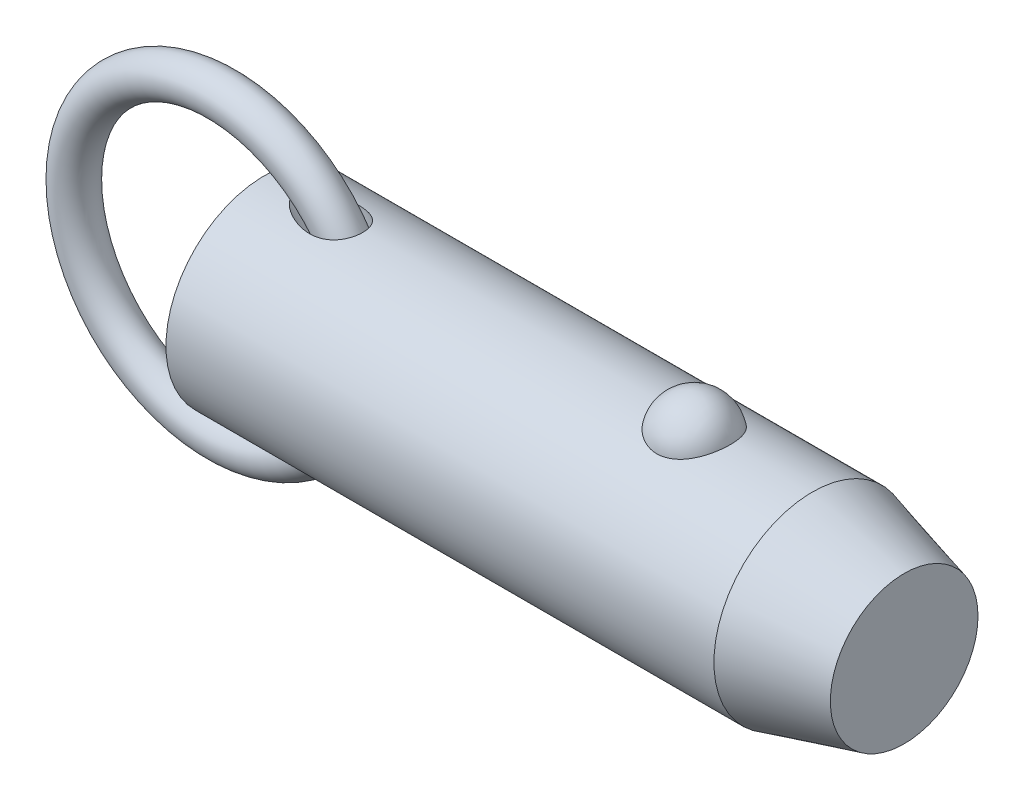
ISO-10303-21;
HEADER;
FILE_DESCRIPTION(('STEP AP214'),'2;1');
FILE_NAME('part.step','',(''),(''),'','','');
FILE_SCHEMA(('AUTOMOTIVE_DESIGN { 1 0 10303 214 1 1 1 1 }'));
ENDSEC;
DATA;
#1=APPLICATION_CONTEXT('core data for automotive mechanical design processes');
#2=APPLICATION_PROTOCOL_DEFINITION('international standard','automotive_design',2000,#1);
#3=PRODUCT_CONTEXT('',#1,'mechanical');
#4=PRODUCT('Part','Part','',(#3));
#5=PRODUCT_RELATED_PRODUCT_CATEGORY('part','',(#4));
#6=PRODUCT_DEFINITION_FORMATION('','',#4);
#7=PRODUCT_DEFINITION_CONTEXT('part definition',#1,'design');
#8=PRODUCT_DEFINITION('design','',#6,#7);
#9=PRODUCT_DEFINITION_SHAPE('','',#8);
#10=(LENGTH_UNIT() NAMED_UNIT(*) SI_UNIT(.MILLI.,.METRE.));
#11=(NAMED_UNIT(*) PLANE_ANGLE_UNIT() SI_UNIT($,.RADIAN.));
#12=(NAMED_UNIT(*) SI_UNIT($,.STERADIAN.) SOLID_ANGLE_UNIT());
#13=UNCERTAINTY_MEASURE_WITH_UNIT(LENGTH_MEASURE(1.E-05),#10,'distance_accuracy_value','');
#14=(GEOMETRIC_REPRESENTATION_CONTEXT(3) GLOBAL_UNCERTAINTY_ASSIGNED_CONTEXT((#13)) GLOBAL_UNIT_ASSIGNED_CONTEXT((#10,
#11,#12)) REPRESENTATION_CONTEXT('',''));
#15=CARTESIAN_POINT('',(0.,0.,0.));
#16=DIRECTION('',(0.,0.,1.));
#17=DIRECTION('',(1.,0.,0.));
#18=AXIS2_PLACEMENT_3D('',#15,#16,#17);
#19=CARTESIAN_POINT('',(-5.53898640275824,0.,0.));
#20=DIRECTION('',(0.,0.,1.));
#21=DIRECTION('',(1.,0.,0.));
#22=AXIS2_PLACEMENT_3D('',#19,#20,#21);
#23=TOROIDAL_SURFACE('',#22,19.05,2.54);
#24=CARTESIAN_POINT('',(16.0510135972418,0.,0.));
#25=VERTEX_POINT('',#24);
#26=VERTEX_LOOP('',#25);
#27=FACE_BOUND('',#26,.T.);
#28=ADVANCED_FACE('P0_F12',(#27),#23,.T.);
#29=CLOSED_SHELL('',(#28));
#30=MANIFOLD_SOLID_BREP('P0_B1',#29);
#31=CARTESIAN_POINT('',(0.,0.,0.));
#32=DIRECTION('',(1.,0.,0.));
#33=DIRECTION('',(0.,0.,-1.));
#34=AXIS2_PLACEMENT_3D('',#31,#32,#33);
#35=CYLINDRICAL_SURFACE('',#34,12.7);
#36=CARTESIAN_POINT('',(70.7007386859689,0.,0.));
#37=DIRECTION('',(1.,0.,0.));
#38=DIRECTION('',(0.,0.,-1.));
#39=AXIS2_PLACEMENT_3D('',#36,#37,#38);
#40=CIRCLE('',#39,12.7);
#41=CARTESIAN_POINT('',(70.7007386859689,0.,-12.7));
#42=VERTEX_POINT('',#41);
#43=EDGE_CURVE('P1_E89',#42,#42,#40,.T.);
#44=ORIENTED_EDGE('',*,*,#43,.F.);
#45=EDGE_LOOP('',(#44));
#46=FACE_BOUND('',#45,.T.);
#47=CARTESIAN_POINT('',(0.,0.,0.));
#48=DIRECTION('',(1.,0.,0.));
#49=DIRECTION('',(0.,0.,-1.));
#50=AXIS2_PLACEMENT_3D('',#47,#48,#49);
#51=CIRCLE('',#50,12.7);
#52=CARTESIAN_POINT('',(0.,0.,-12.7));
#53=VERTEX_POINT('',#52);
#54=EDGE_CURVE('P1_E52',#53,#53,#51,.T.);
#55=ORIENTED_EDGE('',*,*,#54,.T.);
#56=EDGE_LOOP('',(#55));
#57=FACE_BOUND('',#56,.T.);
#58=CARTESIAN_POINT('',(55.4600429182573,11.7500437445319,4.81938502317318));
#59=CARTESIAN_POINT('',(55.3350881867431,11.7500430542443,4.81938571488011));
#60=CARTESIAN_POINT('',(55.210144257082,11.7520975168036,4.81438658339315));
#61=CARTESIAN_POINT('',(54.9611425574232,11.760253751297,4.79442904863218));
#62=CARTESIAN_POINT('',(54.8370850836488,11.7663568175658,4.77946746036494));
#63=CARTESIAN_POINT('',(54.5909016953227,11.7824262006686,4.73971414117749));
#64=CARTESIAN_POINT('',(54.4687744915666,11.7923898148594,4.71492928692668));
#65=CARTESIAN_POINT('',(54.2271874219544,11.8158938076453,4.65571340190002));
#66=CARTESIAN_POINT('',(54.1077285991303,11.8294355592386,4.6212786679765));
#67=CARTESIAN_POINT('',(53.8725578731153,11.8596812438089,4.54309502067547));
#68=CARTESIAN_POINT('',(53.7568393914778,11.8763792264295,4.49936361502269));
#69=CARTESIAN_POINT('',(53.5296530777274,11.9124878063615,4.40287235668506));
#70=CARTESIAN_POINT('',(53.4181868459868,11.9318994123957,4.35010914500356));
#71=CARTESIAN_POINT('',(53.0912782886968,11.9934256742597,4.17881316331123));
#72=CARTESIAN_POINT('',(52.8831270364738,12.038858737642,4.04720756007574));
#73=CARTESIAN_POINT('',(52.4858509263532,12.1352173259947,3.748564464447));
#74=CARTESIAN_POINT('',(52.2974438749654,12.1862630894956,3.58061821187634));
#75=CARTESIAN_POINT('',(51.9505213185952,12.2875163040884,3.21600758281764));
#76=CARTESIAN_POINT('',(51.7920113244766,12.3377235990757,3.0193379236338));
#77=CARTESIAN_POINT('',(51.5016887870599,12.434492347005,2.592916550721));
#78=CARTESIAN_POINT('',(51.3713762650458,12.4807925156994,2.36208286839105));
#79=CARTESIAN_POINT('',(51.1494079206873,12.5623454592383,1.88070399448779));
#80=CARTESIAN_POINT('',(51.0577554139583,12.5975972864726,1.63015711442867));
#81=CARTESIAN_POINT('',(50.9140466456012,12.6538414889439,1.1129886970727));
#82=CARTESIAN_POINT('',(50.8624990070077,12.6746503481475,0.846205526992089));
#83=CARTESIAN_POINT('',(50.8019771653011,12.699153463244,0.307085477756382));
#84=CARTESIAN_POINT('',(50.7930018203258,12.7028481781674,0.0347487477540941));
#85=CARTESIAN_POINT('',(50.8177310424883,12.6927785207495,-0.506073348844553));
#86=CARTESIAN_POINT('',(50.8511899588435,12.6791146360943,-0.774571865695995));
#87=CARTESIAN_POINT('',(50.9596877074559,12.635882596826,-1.30170246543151));
#88=CARTESIAN_POINT('',(51.0347272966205,12.606314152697,-1.5603343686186));
#89=CARTESIAN_POINT('',(51.2250000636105,12.5342328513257,-2.06083899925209));
#90=CARTESIAN_POINT('',(51.3402872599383,12.4917026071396,-2.3026886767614));
#91=CARTESIAN_POINT('',(51.6087044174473,12.3981123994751,-2.76259600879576));
#92=CARTESIAN_POINT('',(51.7618374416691,12.3470517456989,-2.98065173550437));
#93=CARTESIAN_POINT('',(52.1035077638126,12.2416045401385,-3.38786328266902));
#94=CARTESIAN_POINT('',(52.2922017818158,12.1872040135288,-3.57688418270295));
#95=CARTESIAN_POINT('',(52.7002392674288,12.0814086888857,-3.91941073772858));
#96=CARTESIAN_POINT('',(52.9195800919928,12.0300136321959,-4.07291945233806));
#97=CARTESIAN_POINT('',(53.3783753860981,11.9373542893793,-4.33691289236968));
#98=CARTESIAN_POINT('',(53.6173044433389,11.8958982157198,-4.44824125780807));
#99=CARTESIAN_POINT('',(54.1124376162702,11.8268116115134,-4.62881985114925));
#100=CARTESIAN_POINT('',(54.3686351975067,11.7991758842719,-4.69808589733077));
#101=CARTESIAN_POINT('',(54.8771640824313,11.7622209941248,-4.78983181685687));
#102=CARTESIAN_POINT('',(55.1290414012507,11.7520502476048,-4.81449025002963));
#103=CARTESIAN_POINT('',(55.6335734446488,11.7485796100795,-4.82295735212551));
#104=CARTESIAN_POINT('',(55.8862280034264,11.7552763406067,-4.80677420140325));
#105=CARTESIAN_POINT('',(56.3768341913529,11.7842584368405,-4.73525430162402));
#106=CARTESIAN_POINT('',(56.6149984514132,11.8060486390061,-4.68116061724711));
#107=CARTESIAN_POINT('',(57.0784894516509,11.8622750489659,-4.53678133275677));
#108=CARTESIAN_POINT('',(57.3038151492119,11.8967122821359,-4.44649279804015));
#109=CARTESIAN_POINT('',(57.7408018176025,11.9754603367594,-4.2298761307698));
#110=CARTESIAN_POINT('',(57.9520579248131,12.0199699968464,-4.10280539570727));
#111=CARTESIAN_POINT('',(58.3506012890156,12.1138028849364,-3.81685409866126));
#112=CARTESIAN_POINT('',(58.5378830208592,12.163127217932,-3.65796622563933));
#113=CARTESIAN_POINT('',(58.8933509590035,12.2642343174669,-3.30364864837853));
#114=CARTESIAN_POINT('',(59.0601119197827,12.3160165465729,-3.10678783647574));
#115=CARTESIAN_POINT('',(59.3595799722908,12.4142566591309,-2.68748409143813));
#116=CARTESIAN_POINT('',(59.4922809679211,12.4607135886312,-2.46503658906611));
#117=CARTESIAN_POINT('',(59.7246912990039,12.5450236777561,-1.9928951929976));
#118=CARTESIAN_POINT('',(59.823215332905,12.5825557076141,-1.7425591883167));
#119=CARTESIAN_POINT('',(59.9792277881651,12.6431720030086,-1.22773734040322));
#120=CARTESIAN_POINT('',(60.0367157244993,12.6662560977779,-0.963251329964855));
#121=CARTESIAN_POINT('',(60.1095441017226,12.6956486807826,-0.427355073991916));
#122=CARTESIAN_POINT('',(60.1248378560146,12.7019385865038,-0.1559374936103));
#123=CARTESIAN_POINT('',(60.1127794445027,12.6970201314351,0.385928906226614));
#124=CARTESIAN_POINT('',(60.0854280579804,12.6858120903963,0.656377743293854));
#125=CARTESIAN_POINT('',(60.0130609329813,12.6568455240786,1.05454017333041));
#126=CARTESIAN_POINT('',(59.9837963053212,12.6451962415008,1.18577850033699));
#127=CARTESIAN_POINT('',(59.9150228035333,12.6181819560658,1.44513808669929));
#128=CARTESIAN_POINT('',(59.8755176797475,12.6028183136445,1.57326046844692));
#129=CARTESIAN_POINT('',(59.7864397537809,12.5687547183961,1.82554978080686));
#130=CARTESIAN_POINT('',(59.7368627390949,12.5500533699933,1.9497150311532));
#131=CARTESIAN_POINT('',(59.6279211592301,12.5098093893,2.19314370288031));
#132=CARTESIAN_POINT('',(59.5685601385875,12.4882677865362,2.31240887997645));
#133=CARTESIAN_POINT('',(59.4399712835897,12.4427679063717,2.54593031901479));
#134=CARTESIAN_POINT('',(59.3706888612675,12.4187964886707,2.66015396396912));
#135=CARTESIAN_POINT('',(59.222903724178,12.3691892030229,2.88202659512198));
#136=CARTESIAN_POINT('',(59.1444044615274,12.3435539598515,2.98967802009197));
#137=CARTESIAN_POINT('',(58.9785502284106,12.2912955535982,3.19774385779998));
#138=CARTESIAN_POINT('',(58.8911918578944,12.2646720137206,3.29815546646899));
#139=CARTESIAN_POINT('',(58.7081617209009,12.2111945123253,3.49095035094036));
#140=CARTESIAN_POINT('',(58.6124932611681,12.1843406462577,3.58333679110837));
#141=CARTESIAN_POINT('',(58.4136272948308,12.1312249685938,3.75922876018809));
#142=CARTESIAN_POINT('',(58.3104503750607,12.104961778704,3.84275713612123));
#143=CARTESIAN_POINT('',(58.0970133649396,12.0537284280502,4.00056406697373));
#144=CARTESIAN_POINT('',(57.9867562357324,12.028757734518,4.07484645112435));
#145=CARTESIAN_POINT('',(57.7597550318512,11.9808306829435,4.21367959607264));
#146=CARTESIAN_POINT('',(57.6430068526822,11.9578756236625,4.27822410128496));
#147=CARTESIAN_POINT('',(57.4039425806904,11.9147184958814,4.39698483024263));
#148=CARTESIAN_POINT('',(57.2816287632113,11.894515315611,4.45120522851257));
#149=CARTESIAN_POINT('',(57.022952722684,11.8561129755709,4.55255353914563));
#150=CARTESIAN_POINT('',(56.8862237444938,11.8381764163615,4.59884858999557));
#151=CARTESIAN_POINT('',(56.6086087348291,11.8069093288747,4.67853897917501));
#152=CARTESIAN_POINT('',(56.4677245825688,11.7935767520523,4.71194005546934));
#153=CARTESIAN_POINT('',(56.1830944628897,11.7720277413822,4.76552188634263));
#154=CARTESIAN_POINT('',(56.0393488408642,11.7638106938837,4.78570422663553));
#155=CARTESIAN_POINT('',(55.7504114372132,11.7528195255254,4.81263433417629));
#156=CARTESIAN_POINT('',(55.6052198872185,11.7500445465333,4.81938421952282));
#157=CARTESIAN_POINT('',(55.4600429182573,11.7500437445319,4.81938502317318));
#158=B_SPLINE_CURVE_WITH_KNOTS('',3,(#58,#59,#60,#61,#62,#63,#64,#65,#66,#67,#68,#69,#70,#71,
#72,#73,#74,#75,#76,#77,#78,#79,#80,#81,#82,#83,#84,#85,#86,#87,#88,#89,#90,#91,#92,#93,#94,#95,
#96,#97,#98,#99,#100,#101,#102,#103,#104,#105,#106,#107,#108,#109,#110,#111,#112,#113,#114,#115,
#116,#117,#118,#119,#120,#121,#122,#123,#124,#125,#126,#127,#128,#129,#130,#131,#132,#133,#134,
#135,#136,#137,#138,#139,#140,#141,#142,#143,#144,#145,#146,#147,#148,#149,#150,#151,#152,#153,
#154,#155,#156,#157),.UNSPECIFIED.,.T.,.F.,(4,2,2,2,2,2,2,2,2,2,2,2,2,2,2,2,2,2,2,2,2,2,2,2,2,2,
2,2,2,2,2,2,2,2,2,2,2,2,2,2,2,2,2,2,2,2,2,2,2,4),(0.,0.374729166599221,0.749578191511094,
1.12416526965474,1.49889629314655,1.87292776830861,2.24709865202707,2.99481328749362,
3.76399449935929,4.53331735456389,5.3368391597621,6.14042986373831,6.95405296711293,
7.7676542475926,8.57656703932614,9.38549455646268,10.1955119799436,11.0055949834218,
11.8193353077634,12.6330054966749,13.4294141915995,14.2255231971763,14.9815786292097,
15.7374826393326,16.4696948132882,17.2019663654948,17.9501979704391,18.6986017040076,
19.4844704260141,20.2704797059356,21.0815215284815,21.8925729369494,22.7045213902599,
23.5164550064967,23.9209608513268,24.3253187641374,24.7298461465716,25.1342272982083,
25.54092555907,25.9474719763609,26.3541750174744,26.7607169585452,27.1661834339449,
27.5714814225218,27.9770386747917,28.3824315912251,28.8181206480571,29.2536155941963,
29.6890582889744,30.1244323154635),.UNSPECIFIED.);
#159=CARTESIAN_POINT('',(55.4600429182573,11.7500437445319,4.81938502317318));
#160=VERTEX_POINT('',#159);
#161=EDGE_CURVE('P1_E80',#160,#160,#158,.T.);
#162=ORIENTED_EDGE('',*,*,#161,.T.);
#163=EDGE_LOOP('',(#162));
#164=FACE_BOUND('',#163,.T.);
#165=CARTESIAN_POINT('',(-5.53898640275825,0.,0.));
#166=DIRECTION('',(0.796400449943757,-0.604769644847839,0.));
#167=DIRECTION('',(0.604769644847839,0.796400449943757,0.));
#168=AXIS2_PLACEMENT_3D('',#165,#166,#167);
#169=ELLIPSE('',#168,15.9467514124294,12.7);
#170=CARTESIAN_POINT('',(4.0948214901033,12.6864319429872,0.586893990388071));
#171=VERTEX_POINT('',#170);
#172=CARTESIAN_POINT('',(4.0948214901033,12.6864319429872,-0.586893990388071));
#173=VERTEX_POINT('',#172);
#174=EDGE_CURVE('P1_E47',#171,#173,#169,.F.);
#175=ORIENTED_EDGE('',*,*,#174,.T.);
#176=CARTESIAN_POINT('',(4.06153170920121,12.6905758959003,-0.48916605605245));
#177=CARTESIAN_POINT('',(4.08111374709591,12.6881366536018,-0.552489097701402));
#178=CARTESIAN_POINT('',(4.10417851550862,12.6852663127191,-0.614604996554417));
#179=CARTESIAN_POINT('',(4.15628434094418,12.6787965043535,-0.736067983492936));
#180=CARTESIAN_POINT('',(4.18531032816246,12.6751988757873,-0.795421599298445));
#181=CARTESIAN_POINT('',(4.27911159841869,12.6636052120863,-0.967590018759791));
#182=CARTESIAN_POINT('',(4.35123408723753,12.654730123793,-1.07635920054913));
#183=CARTESIAN_POINT('',(4.49106800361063,12.6376715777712,-1.25922957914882));
#184=CARTESIAN_POINT('',(4.55601066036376,12.6297947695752,-1.33556751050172));
#185=CARTESIAN_POINT('',(4.69223626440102,12.6134116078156,-1.4823274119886));
#186=CARTESIAN_POINT('',(4.76352147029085,12.6049050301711,-1.55274725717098));
#187=CARTESIAN_POINT('',(4.91163946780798,12.587417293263,-1.68868704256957));
#188=CARTESIAN_POINT('',(4.98851399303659,12.5784327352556,-1.75416062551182));
#189=CARTESIAN_POINT('',(5.14630057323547,12.560235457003,-1.88003275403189));
#190=CARTESIAN_POINT('',(5.2272139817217,12.5510226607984,-1.94042957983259));
#191=CARTESIAN_POINT('',(5.45368877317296,12.5256514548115,-2.09966332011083));
#192=CARTESIAN_POINT('',(5.60261616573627,12.5094182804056,-2.19371988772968));
#193=CARTESIAN_POINT('',(5.90795545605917,12.4774211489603,-2.36893890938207));
#194=CARTESIAN_POINT('',(6.06437232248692,12.4616575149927,-2.45009264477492));
#195=CARTESIAN_POINT('',(6.38306132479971,12.431227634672,-2.60008249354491));
#196=CARTESIAN_POINT('',(6.54533237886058,12.4165611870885,-2.6689208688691));
#197=CARTESIAN_POINT('',(6.87462618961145,12.3889351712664,-2.79435199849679));
#198=CARTESIAN_POINT('',(7.04164773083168,12.3759751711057,-2.85094785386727));
#199=CARTESIAN_POINT('',(7.38726647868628,12.3518460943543,-2.95377962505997));
#200=CARTESIAN_POINT('',(7.56604577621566,12.3407843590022,-2.99943209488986));
#201=CARTESIAN_POINT('',(7.92698692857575,12.3219309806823,-3.07596683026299));
#202=CARTESIAN_POINT('',(8.10914972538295,12.314140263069,-3.10684491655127));
#203=CARTESIAN_POINT('',(8.47511457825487,12.3025918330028,-3.15226850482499));
#204=CARTESIAN_POINT('',(8.65890979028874,12.2988216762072,-3.16686440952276));
#205=CARTESIAN_POINT('',(9.02696087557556,12.2959421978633,-3.17802250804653));
#206=CARTESIAN_POINT('',(9.2112162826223,12.2968292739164,-3.17459864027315));
#207=CARTESIAN_POINT('',(9.61636263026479,12.3045198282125,-3.14471110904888));
#208=CARTESIAN_POINT('',(9.8369555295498,12.3125080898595,-3.11363232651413));
#209=CARTESIAN_POINT('',(10.1619126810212,12.3303028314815,-3.04206574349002));
#210=CARTESIAN_POINT('',(10.2692747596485,12.3372061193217,-3.01403983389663));
#211=CARTESIAN_POINT('',(10.4811758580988,12.3528538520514,-2.94925947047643));
#212=CARTESIAN_POINT('',(10.5857162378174,12.361597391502,-2.91250930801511));
#213=CARTESIAN_POINT('',(10.792132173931,12.3808585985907,-2.82951748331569));
#214=CARTESIAN_POINT('',(10.8939665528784,12.3913944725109,-2.78317723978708));
#215=CARTESIAN_POINT('',(11.092611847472,12.4138762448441,-2.68112002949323));
#216=CARTESIAN_POINT('',(11.1894254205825,12.4258213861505,-2.62540809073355));
#217=CARTESIAN_POINT('',(11.3768740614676,12.4507225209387,-2.50465655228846));
#218=CARTESIAN_POINT('',(11.4675115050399,12.4636781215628,-2.43962056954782));
#219=CARTESIAN_POINT('',(11.6414572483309,12.4901070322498,-2.30048560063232));
#220=CARTESIAN_POINT('',(11.7247669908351,12.5035802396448,-2.22638840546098));
#221=CARTESIAN_POINT('',(11.8713131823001,12.5285000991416,-2.08117367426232));
#222=CARTESIAN_POINT('',(11.9357009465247,12.5399538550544,-2.01121596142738));
#223=CARTESIAN_POINT('',(12.0576805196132,12.5624496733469,-1.86555293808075));
#224=CARTESIAN_POINT('',(12.1152732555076,12.5734917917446,-1.78984841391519));
#225=CARTESIAN_POINT('',(12.223073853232,12.5947858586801,-1.63327883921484));
#226=CARTESIAN_POINT('',(12.2732844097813,12.6050380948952,-1.55241568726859));
#227=CARTESIAN_POINT('',(12.3658430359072,12.6243983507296,-1.38621267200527));
#228=CARTESIAN_POINT('',(12.4081916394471,12.6335064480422,-1.30087311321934));
#229=CARTESIAN_POINT('',(12.5150098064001,12.6569076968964,-1.05702619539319));
#230=CARTESIAN_POINT('',(12.5703399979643,12.6695746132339,-0.894232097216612));
#231=CARTESIAN_POINT('',(12.6526225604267,12.6886816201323,-0.561391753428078));
#232=CARTESIAN_POINT('',(12.6795825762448,12.6951233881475,-0.391347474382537));
#233=CARTESIAN_POINT('',(12.7041016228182,12.7009766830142,-0.0537636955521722));
#234=CARTESIAN_POINT('',(12.7024538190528,12.7005778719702,0.113714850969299));
#235=CARTESIAN_POINT('',(12.6717240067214,12.6932548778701,0.445979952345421));
#236=CARTESIAN_POINT('',(12.6426435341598,12.6863310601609,0.610766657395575));
#237=CARTESIAN_POINT('',(12.5579769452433,12.6667465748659,0.932429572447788));
#238=CARTESIAN_POINT('',(12.5024793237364,12.6541050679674,1.08933027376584));
#239=CARTESIAN_POINT('',(12.3665691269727,12.6244558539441,1.39146752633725));
#240=CARTESIAN_POINT('',(12.2861577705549,12.6074483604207,1.53670464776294));
#241=CARTESIAN_POINT('',(12.1018203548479,12.5706804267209,1.81319588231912));
#242=CARTESIAN_POINT('',(11.9976588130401,12.5508932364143,1.94428915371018));
#243=CARTESIAN_POINT('',(11.7695265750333,12.5107540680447,2.18776051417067));
#244=CARTESIAN_POINT('',(11.6455540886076,12.4904020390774,2.30013691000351));
#245=CARTESIAN_POINT('',(11.3759347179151,12.4502278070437,2.50870972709));
#246=CARTESIAN_POINT('',(11.2295880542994,12.4304654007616,2.60400962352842));
#247=CARTESIAN_POINT('',(10.9239803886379,12.3941696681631,2.77162929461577));
#248=CARTESIAN_POINT('',(10.7647152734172,12.3776373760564,2.84394171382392));
#249=CARTESIAN_POINT('',(10.4192039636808,12.3473062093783,2.97303525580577));
#250=CARTESIAN_POINT('',(10.2319332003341,12.3340204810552,3.027171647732));
#251=CARTESIAN_POINT('',(9.85152982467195,12.3134301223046,3.10986173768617));
#252=CARTESIAN_POINT('',(9.65839336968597,12.3061295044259,3.13839827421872));
#253=CARTESIAN_POINT('',(9.31022514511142,12.2982822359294,3.16897517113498));
#254=CARTESIAN_POINT('',(9.15555718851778,12.2966525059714,3.17526894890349));
#255=CARTESIAN_POINT('',(8.8461894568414,12.2967963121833,3.17471335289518));
#256=CARTESIAN_POINT('',(8.69148970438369,12.2985715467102,3.16785742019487));
#257=CARTESIAN_POINT('',(8.38280471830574,12.3051648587,3.14214692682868));
#258=CARTESIAN_POINT('',(8.22882218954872,12.3099904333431,3.12326280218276));
#259=CARTESIAN_POINT('',(7.92276070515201,12.3222644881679,3.07448013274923));
#260=CARTESIAN_POINT('',(7.77068148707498,12.3297126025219,3.04458312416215));
#261=CARTESIAN_POINT('',(7.46452663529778,12.3470493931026,2.97350781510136));
#262=CARTESIAN_POINT('',(7.31052714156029,12.3570043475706,2.93201910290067));
#263=CARTESIAN_POINT('',(7.00579083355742,12.3787609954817,2.83876185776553));
#264=CARTESIAN_POINT('',(6.85505451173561,12.3905629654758,2.7869917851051));
#265=CARTESIAN_POINT('',(6.55781208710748,12.415528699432,2.67357744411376));
#266=CARTESIAN_POINT('',(6.41129783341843,12.4286895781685,2.61195394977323));
#267=CARTESIAN_POINT('',(6.12302950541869,12.4559398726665,2.47874512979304));
#268=CARTESIAN_POINT('',(5.98127390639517,12.4700289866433,2.40716303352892));
#269=CARTESIAN_POINT('',(5.67073126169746,12.5020754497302,2.2355042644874));
#270=CARTESIAN_POINT('',(5.50343839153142,12.5201625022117,2.13268685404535));
#271=CARTESIAN_POINT('',(5.26147616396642,12.5471537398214,1.96522579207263));
#272=CARTESIAN_POINT('',(5.18224299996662,12.5561365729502,1.90713440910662));
#273=CARTESIAN_POINT('',(5.0274647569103,12.573912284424,1.78618989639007));
#274=CARTESIAN_POINT('',(4.95191912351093,12.5827051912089,1.72333748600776));
#275=CARTESIAN_POINT('',(4.81787163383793,12.598469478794,1.60360864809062));
#276=CARTESIAN_POINT('',(4.75865966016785,12.6054958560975,1.54753994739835));
#277=CARTESIAN_POINT('',(4.64406285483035,12.6191906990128,1.43158546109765));
#278=CARTESIAN_POINT('',(4.58867926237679,12.6258590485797,1.37169845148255));
#279=CARTESIAN_POINT('',(4.43014912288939,12.6450546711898,1.18656670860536));
#280=CARTESIAN_POINT('',(4.33372726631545,12.6568788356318,1.05507993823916));
#281=CARTESIAN_POINT('',(4.21252055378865,12.6718304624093,0.848052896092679));
#282=CARTESIAN_POINT('',(4.17660155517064,12.6762773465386,0.779100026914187));
#283=CARTESIAN_POINT('',(4.11264979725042,12.6842122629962,0.63708048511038));
#284=CARTESIAN_POINT('',(4.08466792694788,12.6876941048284,0.56399071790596));
#285=CARTESIAN_POINT('',(4.0615317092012,12.6905758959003,0.489166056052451));
#286=B_SPLINE_CURVE_WITH_KNOTS('',3,(#176,#177,#178,#179,#180,#181,#182,#183,#184,#185,#186,
#187,#188,#189,#190,#191,#192,#193,#194,#195,#196,#197,#198,#199,#200,#201,#202,#203,#204,#205,
#206,#207,#208,#209,#210,#211,#212,#213,#214,#215,#216,#217,#218,#219,#220,#221,#222,#223,#224,
#225,#226,#227,#228,#229,#230,#231,#232,#233,#234,#235,#236,#237,#238,#239,#240,#241,#242,#243,
#244,#245,#246,#247,#248,#249,#250,#251,#252,#253,#254,#255,#256,#257,#258,#259,#260,#261,#262,
#263,#264,#265,#266,#267,#268,#269,#270,#271,#272,#273,#274,#275,#276,#277,#278,#279,#280,#281,
#282,#283,#284,#285),.UNSPECIFIED.,.F.,.F.,(4,2,2,2,2,2,2,2,2,2,2,2,2,2,2,2,2,2,2,2,2,2,2,2,2,2,
2,2,2,2,2,2,2,2,2,2,2,2,2,2,2,2,2,2,2,2,2,2,2,2,2,2,2,2,4),(0.,0.198708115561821,
0.39691995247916,0.787580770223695,1.08882492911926,1.39017679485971,1.69407136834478,
1.9980684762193,2.52793143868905,3.05815092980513,3.58827293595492,4.11826050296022,
4.67218806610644,5.22627222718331,5.77863637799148,6.33057333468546,6.99657211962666,
7.3297741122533,7.66281254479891,7.99946156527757,8.33593054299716,8.67226935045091,
9.00854178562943,9.29544181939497,9.58230266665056,9.86905853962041,10.155794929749,
10.670233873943,11.184534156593,11.6845985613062,12.1846349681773,12.6830079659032,
13.1813565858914,13.6848795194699,14.1884479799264,14.713533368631,15.2387866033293,
15.8228373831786,16.4072794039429,16.8710810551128,17.3351141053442,17.8002921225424,
18.2654052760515,18.7444169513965,19.2235004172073,19.7015868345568,20.1795185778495,
20.7699825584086,21.0658110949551,21.361595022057,21.6069574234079,21.8523988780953,
22.3397467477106,22.5729183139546,22.8075527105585),.UNSPECIFIED.);
#287=EDGE_CURVE('P1_E51',#173,#171,#286,.T.);
#288=ORIENTED_EDGE('',*,*,#287,.T.);
#289=EDGE_LOOP('',(#175,#288));
#290=FACE_BOUND('',#289,.T.);
#291=CARTESIAN_POINT('',(-5.53898640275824,0.,0.));
#292=DIRECTION('',(-0.796400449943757,-0.604769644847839,0.));
#293=DIRECTION('',(0.604769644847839,-0.796400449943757,0.));
#294=AXIS2_PLACEMENT_3D('',#291,#292,#293);
#295=ELLIPSE('',#294,15.9467514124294,12.7);
#296=CARTESIAN_POINT('',(4.09482149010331,-12.6864319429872,0.586893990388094));
#297=VERTEX_POINT('',#296);
#298=CARTESIAN_POINT('',(4.09482149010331,-12.6864319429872,-0.586893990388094));
#299=VERTEX_POINT('',#298);
#300=EDGE_CURVE('P1_E28',#297,#299,#295,.F.);
#301=ORIENTED_EDGE('',*,*,#300,.F.);
#302=CARTESIAN_POINT('',(4.06153170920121,-12.6905758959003,0.489166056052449));
#303=CARTESIAN_POINT('',(4.08111374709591,-12.6881366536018,0.552489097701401));
#304=CARTESIAN_POINT('',(4.10417851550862,-12.6852663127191,0.614604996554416));
#305=CARTESIAN_POINT('',(4.15628434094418,-12.6787965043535,0.736067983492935));
#306=CARTESIAN_POINT('',(4.18531032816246,-12.6751988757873,0.795421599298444));
#307=CARTESIAN_POINT('',(4.27911159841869,-12.6636052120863,0.967590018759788));
#308=CARTESIAN_POINT('',(4.35123408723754,-12.654730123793,1.07635920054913));
#309=CARTESIAN_POINT('',(4.49106800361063,-12.6376715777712,1.25922957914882));
#310=CARTESIAN_POINT('',(4.55601066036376,-12.6297947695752,1.33556751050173));
#311=CARTESIAN_POINT('',(4.69223626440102,-12.6134116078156,1.4823274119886));
#312=CARTESIAN_POINT('',(4.76352147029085,-12.6049050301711,1.55274725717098));
#313=CARTESIAN_POINT('',(4.91163946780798,-12.587417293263,1.68868704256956));
#314=CARTESIAN_POINT('',(4.98851399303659,-12.5784327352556,1.75416062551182));
#315=CARTESIAN_POINT('',(5.14630057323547,-12.560235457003,1.88003275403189));
#316=CARTESIAN_POINT('',(5.2272139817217,-12.5510226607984,1.94042957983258));
#317=CARTESIAN_POINT('',(5.45368877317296,-12.5256514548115,2.09966332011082));
#318=CARTESIAN_POINT('',(5.60261616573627,-12.5094182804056,2.19371988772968));
#319=CARTESIAN_POINT('',(5.90795545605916,-12.4774211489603,2.36893890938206));
#320=CARTESIAN_POINT('',(6.06437232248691,-12.4616575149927,2.45009264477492));
#321=CARTESIAN_POINT('',(6.3830613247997,-12.431227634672,2.6000824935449));
#322=CARTESIAN_POINT('',(6.54533237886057,-12.4165611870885,2.66892086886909));
#323=CARTESIAN_POINT('',(6.87462618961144,-12.3889351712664,2.79435199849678));
#324=CARTESIAN_POINT('',(7.04164773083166,-12.3759751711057,2.85094785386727));
#325=CARTESIAN_POINT('',(7.38726647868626,-12.3518460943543,2.95377962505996));
#326=CARTESIAN_POINT('',(7.56604577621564,-12.3407843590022,2.99943209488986));
#327=CARTESIAN_POINT('',(7.92698692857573,-12.3219309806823,3.07596683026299));
#328=CARTESIAN_POINT('',(8.10914972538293,-12.314140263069,3.10684491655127));
#329=CARTESIAN_POINT('',(8.47511457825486,-12.3025918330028,3.15226850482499));
#330=CARTESIAN_POINT('',(8.65890979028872,-12.2988216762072,3.16686440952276));
#331=CARTESIAN_POINT('',(9.02696087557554,-12.2959421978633,3.17802250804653));
#332=CARTESIAN_POINT('',(9.21121628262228,-12.2968292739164,3.17459864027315));
#333=CARTESIAN_POINT('',(9.61636263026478,-12.3045198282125,3.14471110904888));
#334=CARTESIAN_POINT('',(9.83695552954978,-12.3125080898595,3.11363232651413));
#335=CARTESIAN_POINT('',(10.1619126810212,-12.3303028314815,3.04206574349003));
#336=CARTESIAN_POINT('',(10.2692747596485,-12.3372061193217,3.01403983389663));
#337=CARTESIAN_POINT('',(10.4811758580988,-12.3528538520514,2.94925947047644));
#338=CARTESIAN_POINT('',(10.5857162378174,-12.361597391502,2.91250930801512));
#339=CARTESIAN_POINT('',(10.792132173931,-12.3808585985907,2.8295174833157));
#340=CARTESIAN_POINT('',(10.8939665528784,-12.3913944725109,2.78317723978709));
#341=CARTESIAN_POINT('',(11.092611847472,-12.4138762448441,2.68112002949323));
#342=CARTESIAN_POINT('',(11.1894254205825,-12.4258213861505,2.62540809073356));
#343=CARTESIAN_POINT('',(11.3768740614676,-12.4507225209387,2.50465655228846));
#344=CARTESIAN_POINT('',(11.4675115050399,-12.4636781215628,2.43962056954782));
#345=CARTESIAN_POINT('',(11.6414572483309,-12.4901070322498,2.30048560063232));
#346=CARTESIAN_POINT('',(11.7247669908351,-12.5035802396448,2.22638840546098));
#347=CARTESIAN_POINT('',(11.8713131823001,-12.5285000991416,2.08117367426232));
#348=CARTESIAN_POINT('',(11.9357009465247,-12.5399538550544,2.01121596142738));
#349=CARTESIAN_POINT('',(12.0576805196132,-12.5624496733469,1.86555293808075));
#350=CARTESIAN_POINT('',(12.1152732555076,-12.5734917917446,1.78984841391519));
#351=CARTESIAN_POINT('',(12.223073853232,-12.5947858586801,1.63327883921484));
#352=CARTESIAN_POINT('',(12.2732844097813,-12.6050380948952,1.55241568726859));
#353=CARTESIAN_POINT('',(12.3658430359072,-12.6243983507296,1.38621267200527));
#354=CARTESIAN_POINT('',(12.4081916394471,-12.6335064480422,1.30087311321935));
#355=CARTESIAN_POINT('',(12.5150098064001,-12.6569076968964,1.05702619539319));
#356=CARTESIAN_POINT('',(12.5703399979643,-12.6695746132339,0.894232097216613));
#357=CARTESIAN_POINT('',(12.6526225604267,-12.6886816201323,0.561391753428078));
#358=CARTESIAN_POINT('',(12.6795825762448,-12.6951233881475,0.391347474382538));
#359=CARTESIAN_POINT('',(12.7041016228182,-12.7009766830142,0.0537636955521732));
#360=CARTESIAN_POINT('',(12.7024538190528,-12.7005778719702,-0.113714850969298));
#361=CARTESIAN_POINT('',(12.6717240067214,-12.6932548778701,-0.44597995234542));
#362=CARTESIAN_POINT('',(12.6426435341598,-12.6863310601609,-0.610766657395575));
#363=CARTESIAN_POINT('',(12.5579769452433,-12.6667465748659,-0.932429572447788));
#364=CARTESIAN_POINT('',(12.5024793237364,-12.6541050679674,-1.08933027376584));
#365=CARTESIAN_POINT('',(12.3665691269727,-12.6244558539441,-1.39146752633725));
#366=CARTESIAN_POINT('',(12.2861577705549,-12.6074483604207,-1.53670464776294));
#367=CARTESIAN_POINT('',(12.1018203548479,-12.5706804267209,-1.81319588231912));
#368=CARTESIAN_POINT('',(11.9976588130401,-12.5508932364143,-1.94428915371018));
#369=CARTESIAN_POINT('',(11.7695265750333,-12.5107540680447,-2.18776051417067));
#370=CARTESIAN_POINT('',(11.6455540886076,-12.4904020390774,-2.30013691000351));
#371=CARTESIAN_POINT('',(11.3759347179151,-12.4502278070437,-2.50870972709));
#372=CARTESIAN_POINT('',(11.2295880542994,-12.4304654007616,-2.60400962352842));
#373=CARTESIAN_POINT('',(10.9239803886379,-12.3941696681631,-2.77162929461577));
#374=CARTESIAN_POINT('',(10.7647152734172,-12.3776373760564,-2.84394171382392));
#375=CARTESIAN_POINT('',(10.4192039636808,-12.3473062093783,-2.97303525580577));
#376=CARTESIAN_POINT('',(10.2319332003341,-12.3340204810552,-3.027171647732));
#377=CARTESIAN_POINT('',(9.85152982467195,-12.3134301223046,-3.10986173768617));
#378=CARTESIAN_POINT('',(9.65839336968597,-12.3061295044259,-3.13839827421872));
#379=CARTESIAN_POINT('',(9.31022514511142,-12.2982822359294,-3.16897517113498));
#380=CARTESIAN_POINT('',(9.15555718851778,-12.2966525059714,-3.17526894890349));
#381=CARTESIAN_POINT('',(8.8461894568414,-12.2967963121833,-3.17471335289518));
#382=CARTESIAN_POINT('',(8.69148970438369,-12.2985715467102,-3.16785742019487));
#383=CARTESIAN_POINT('',(8.38280471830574,-12.3051648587,-3.14214692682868));
#384=CARTESIAN_POINT('',(8.22882218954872,-12.3099904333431,-3.12326280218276));
#385=CARTESIAN_POINT('',(7.92276070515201,-12.3222644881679,-3.07448013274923));
#386=CARTESIAN_POINT('',(7.77068148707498,-12.3297126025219,-3.04458312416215));
#387=CARTESIAN_POINT('',(7.46452663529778,-12.3470493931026,-2.97350781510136));
#388=CARTESIAN_POINT('',(7.31052714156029,-12.3570043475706,-2.93201910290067));
#389=CARTESIAN_POINT('',(7.00579083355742,-12.3787609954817,-2.83876185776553));
#390=CARTESIAN_POINT('',(6.85505451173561,-12.3905629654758,-2.7869917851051));
#391=CARTESIAN_POINT('',(6.55781208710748,-12.415528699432,-2.67357744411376));
#392=CARTESIAN_POINT('',(6.41129783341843,-12.4286895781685,-2.61195394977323));
#393=CARTESIAN_POINT('',(6.12302950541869,-12.4559398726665,-2.47874512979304));
#394=CARTESIAN_POINT('',(5.98127390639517,-12.4700289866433,-2.40716303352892));
#395=CARTESIAN_POINT('',(5.67073126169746,-12.5020754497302,-2.2355042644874));
#396=CARTESIAN_POINT('',(5.50343839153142,-12.5201625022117,-2.13268685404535));
#397=CARTESIAN_POINT('',(5.26147616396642,-12.5471537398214,-1.96522579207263));
#398=CARTESIAN_POINT('',(5.18224299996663,-12.5561365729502,-1.90713440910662));
#399=CARTESIAN_POINT('',(5.0274647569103,-12.573912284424,-1.78618989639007));
#400=CARTESIAN_POINT('',(4.95191912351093,-12.5827051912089,-1.72333748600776));
#401=CARTESIAN_POINT('',(4.81787163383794,-12.598469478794,-1.60360864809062));
#402=CARTESIAN_POINT('',(4.75865966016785,-12.6054958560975,-1.54753994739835));
#403=CARTESIAN_POINT('',(4.64406285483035,-12.6191906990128,-1.43158546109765));
#404=CARTESIAN_POINT('',(4.58867926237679,-12.6258590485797,-1.37169845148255));
#405=CARTESIAN_POINT('',(4.43014912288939,-12.6450546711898,-1.18656670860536));
#406=CARTESIAN_POINT('',(4.33372726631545,-12.6568788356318,-1.05507993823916));
#407=CARTESIAN_POINT('',(4.21252055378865,-12.6718304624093,-0.848052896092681));
#408=CARTESIAN_POINT('',(4.17660155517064,-12.6762773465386,-0.779100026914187));
#409=CARTESIAN_POINT('',(4.11264979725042,-12.6842122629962,-0.637080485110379));
#410=CARTESIAN_POINT('',(4.08466792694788,-12.6876941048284,-0.563990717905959));
#411=CARTESIAN_POINT('',(4.06153170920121,-12.6905758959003,-0.48916605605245));
#412=B_SPLINE_CURVE_WITH_KNOTS('',3,(#302,#303,#304,#305,#306,#307,#308,#309,#310,#311,#312,
#313,#314,#315,#316,#317,#318,#319,#320,#321,#322,#323,#324,#325,#326,#327,#328,#329,#330,#331,
#332,#333,#334,#335,#336,#337,#338,#339,#340,#341,#342,#343,#344,#345,#346,#347,#348,#349,#350,
#351,#352,#353,#354,#355,#356,#357,#358,#359,#360,#361,#362,#363,#364,#365,#366,#367,#368,#369,
#370,#371,#372,#373,#374,#375,#376,#377,#378,#379,#380,#381,#382,#383,#384,#385,#386,#387,#388,
#389,#390,#391,#392,#393,#394,#395,#396,#397,#398,#399,#400,#401,#402,#403,#404,#405,#406,#407,
#408,#409,#410,#411),.UNSPECIFIED.,.F.,.F.,(4,2,2,2,2,2,2,2,2,2,2,2,2,2,2,2,2,2,2,2,2,2,2,2,2,2,
2,2,2,2,2,2,2,2,2,2,2,2,2,2,2,2,2,2,2,2,2,2,2,2,2,2,2,2,4),(0.,0.198708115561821,
0.39691995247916,0.787580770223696,1.08882492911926,1.39017679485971,1.69407136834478,
1.9980684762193,2.52793143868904,3.05815092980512,3.58827293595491,4.11826050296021,
4.67218806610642,5.22627222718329,5.77863637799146,6.33057333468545,6.99657211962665,
7.32977411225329,7.6628125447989,7.99946156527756,8.33593054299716,8.67226935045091,
9.00854178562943,9.29544181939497,9.58230266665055,9.86905853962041,10.155794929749,
10.670233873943,11.184534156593,11.6845985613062,12.1846349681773,12.6830079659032,
13.1813565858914,13.6848795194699,14.1884479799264,14.713533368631,15.2387866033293,
15.8228373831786,16.4072794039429,16.8710810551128,17.3351141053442,17.8002921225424,
18.2654052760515,18.7444169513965,19.2235004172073,19.7015868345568,20.1795185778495,
20.7699825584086,21.0658110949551,21.361595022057,21.6069574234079,21.8523988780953,
22.3397467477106,22.5729183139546,22.8075527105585),.UNSPECIFIED.);
#413=EDGE_CURVE('P1_E10',#297,#299,#412,.T.);
#414=ORIENTED_EDGE('',*,*,#413,.T.);
#415=EDGE_LOOP('',(#301,#414));
#416=FACE_BOUND('',#415,.T.);
#417=ADVANCED_FACE('P1_F15',(#46,#57,#164,#290,#416),#35,.T.);
#418=CARTESIAN_POINT('',(0.,0.,0.));
#419=DIRECTION('',(-1.,0.,0.));
#420=DIRECTION('',(0.,0.,1.));
#421=AXIS2_PLACEMENT_3D('',#418,#419,#420);
#422=PLANE('',#421);
#423=ORIENTED_EDGE('',*,*,#54,.F.);
#424=EDGE_LOOP('',(#423));
#425=FACE_BOUND('',#424,.T.);
#426=ADVANCED_FACE('P1_F17',(#425),#422,.T.);
#427=CARTESIAN_POINT('',(82.55,0.,0.));
#428=DIRECTION('',(-1.,0.,0.));
#429=DIRECTION('',(0.,0.,1.));
#430=AXIS2_PLACEMENT_3D('',#427,#428,#429);
#431=CONICAL_SURFACE('',#430,9.52500000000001,0.26179938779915);
#432=ORIENTED_EDGE('',*,*,#43,.T.);
#433=EDGE_LOOP('',(#432));
#434=FACE_BOUND('',#433,.T.);
#435=CARTESIAN_POINT('',(82.55,0.,0.));
#436=DIRECTION('',(1.,0.,0.));
#437=DIRECTION('',(0.,0.,-1.));
#438=AXIS2_PLACEMENT_3D('',#435,#436,#437);
#439=CIRCLE('',#438,9.52500000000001);
#440=CARTESIAN_POINT('',(82.55,0.,-9.52500000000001));
#441=VERTEX_POINT('',#440);
#442=EDGE_CURVE('P1_E86',#441,#441,#439,.T.);
#443=ORIENTED_EDGE('',*,*,#442,.F.);
#444=EDGE_LOOP('',(#443));
#445=FACE_BOUND('',#444,.T.);
#446=ADVANCED_FACE('P1_F105',(#434,#445),#431,.T.);
#447=CARTESIAN_POINT('',(82.55,9.52500000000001,0.));
#448=DIRECTION('',(1.,0.,0.));
#449=DIRECTION('',(0.,0.,-1.));
#450=AXIS2_PLACEMENT_3D('',#447,#448,#449);
#451=PLANE('',#450);
#452=ORIENTED_EDGE('',*,*,#442,.T.);
#453=EDGE_LOOP('',(#452));
#454=FACE_BOUND('',#453,.T.);
#455=ADVANCED_FACE('P1_F78',(#454),#451,.T.);
#456=CARTESIAN_POINT('',(55.4600429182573,11.43,0.));
#457=DIRECTION('',(-1.,0.,0.));
#458=DIRECTION('',(0.,1.,0.));
#459=AXIS2_PLACEMENT_3D('',#456,#457,#458);
#460=SPHERICAL_SURFACE('',#459,4.83);
#461=ORIENTED_EDGE('',*,*,#161,.F.);
#462=EDGE_LOOP('',(#461));
#463=FACE_BOUND('',#462,.T.);
#464=ADVANCED_FACE('P1_F71',(#463),#460,.T.);
#465=CARTESIAN_POINT('',(-5.53898640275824,0.,0.));
#466=DIRECTION('',(0.,0.,1.));
#467=DIRECTION('',(1.,0.,0.));
#468=AXIS2_PLACEMENT_3D('',#465,#466,#467);
#469=TOROIDAL_SURFACE('',#468,19.05,3.175);
#470=CARTESIAN_POINT('',(5.9818753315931,-15.1714285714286,0.));
#471=DIRECTION('',(-0.796400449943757,-0.604769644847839,0.));
#472=DIRECTION('',(0.604769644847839,-0.796400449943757,0.));
#473=AXIS2_PLACEMENT_3D('',#470,#471,#472);
#474=CIRCLE('',#473,3.175);
#475=EDGE_CURVE('P1_E34',#297,#299,#474,.T.);
#476=ORIENTED_EDGE('',*,*,#475,.T.);
#477=ORIENTED_EDGE('',*,*,#413,.F.);
#478=EDGE_LOOP('',(#476,#477));
#479=FACE_BOUND('',#478,.T.);
#480=CARTESIAN_POINT('',(5.9818753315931,15.1714285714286,0.));
#481=DIRECTION('',(0.796400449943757,-0.604769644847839,0.));
#482=DIRECTION('',(0.604769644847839,0.796400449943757,0.));
#483=AXIS2_PLACEMENT_3D('',#480,#481,#482);
#484=CIRCLE('',#483,3.175);
#485=EDGE_CURVE('P1_E41',#171,#173,#484,.T.);
#486=ORIENTED_EDGE('',*,*,#485,.F.);
#487=ORIENTED_EDGE('',*,*,#287,.F.);
#488=EDGE_LOOP('',(#486,#487));
#489=FACE_BOUND('',#488,.T.);
#490=ADVANCED_FACE('P1_F55',(#479,#489),#469,.F.);
#491=CARTESIAN_POINT('',(5.9818753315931,-15.1714285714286,0.));
#492=DIRECTION('',(-0.796400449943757,-0.604769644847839,0.));
#493=DIRECTION('',(0.604769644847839,-0.796400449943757,0.));
#494=AXIS2_PLACEMENT_3D('',#491,#492,#493);
#495=PLANE('',#494);
#496=ORIENTED_EDGE('',*,*,#300,.T.);
#497=ORIENTED_EDGE('',*,*,#475,.F.);
#498=EDGE_LOOP('',(#496,#497));
#499=FACE_BOUND('',#498,.T.);
#500=ADVANCED_FACE('P1_F70',(#499),#495,.F.);
#501=CARTESIAN_POINT('',(5.9818753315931,15.1714285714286,0.));
#502=DIRECTION('',(0.796400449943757,-0.604769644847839,0.));
#503=DIRECTION('',(0.604769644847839,0.796400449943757,0.));
#504=AXIS2_PLACEMENT_3D('',#501,#502,#503);
#505=PLANE('',#504);
#506=ORIENTED_EDGE('',*,*,#485,.T.);
#507=ORIENTED_EDGE('',*,*,#174,.F.);
#508=EDGE_LOOP('',(#506,#507));
#509=FACE_BOUND('',#508,.T.);
#510=ADVANCED_FACE('P1_F48',(#509),#505,.T.);
#511=CLOSED_SHELL('',(#417,#426,#446,#455,#464,#490,#500,#510));
#512=MANIFOLD_SOLID_BREP('P1_B1',#511);
#513=ADVANCED_BREP_SHAPE_REPRESENTATION('',(#18,#30,#512),#14);
#514=SHAPE_DEFINITION_REPRESENTATION(#9,#513);
ENDSEC;
END-ISO-10303-21;
